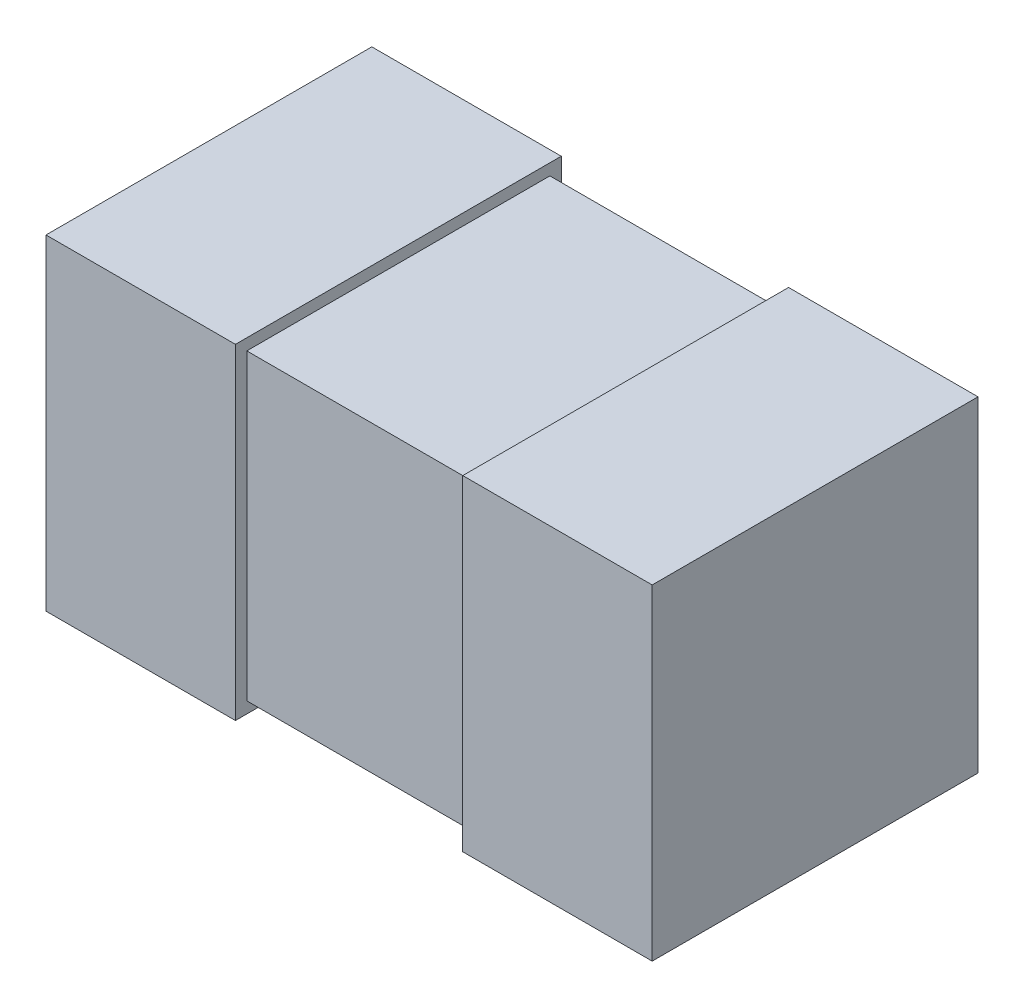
from build123d import *

# Parameters (mm, degrees)
SKETCH1_W           = 1.6
SKETCH1_H           = 0.8
EXTRUDE1_DEPTH      = 0.8
EXTRUDE2_DEPTH      = 0.43
EXTRUDE2_DEPTH_BACK = 0.43
SKETCH2_W           = 0.5
SKETCH2_H           = 0.86


with BuildPart() as part:
    # Sketch1 → Extrude1 (new body)
    with BuildSketch(Plane(origin=(0, 0, 0), x_dir=(1, 0, 0), z_dir=(0, 1, 0))):
        Rectangle(SKETCH1_W, SKETCH1_H)
    extrude(amount=EXTRUDE1_DEPTH)

    # Sketch2 → Extrude2 (add, two sides: drawn at the far end of the back side and taken through both)
    with BuildSketch(Plane.XY.offset(-EXTRUDE2_DEPTH_BACK)):
        with Locations((-0.55, 0.4)):
            Rectangle(SKETCH2_W, SKETCH2_H)
        with Locations((0.55, 0.4)):
            Rectangle(SKETCH2_W, SKETCH2_H)
    extrude(amount=EXTRUDE2_DEPTH + EXTRUDE2_DEPTH_BACK)


solid = part.part
